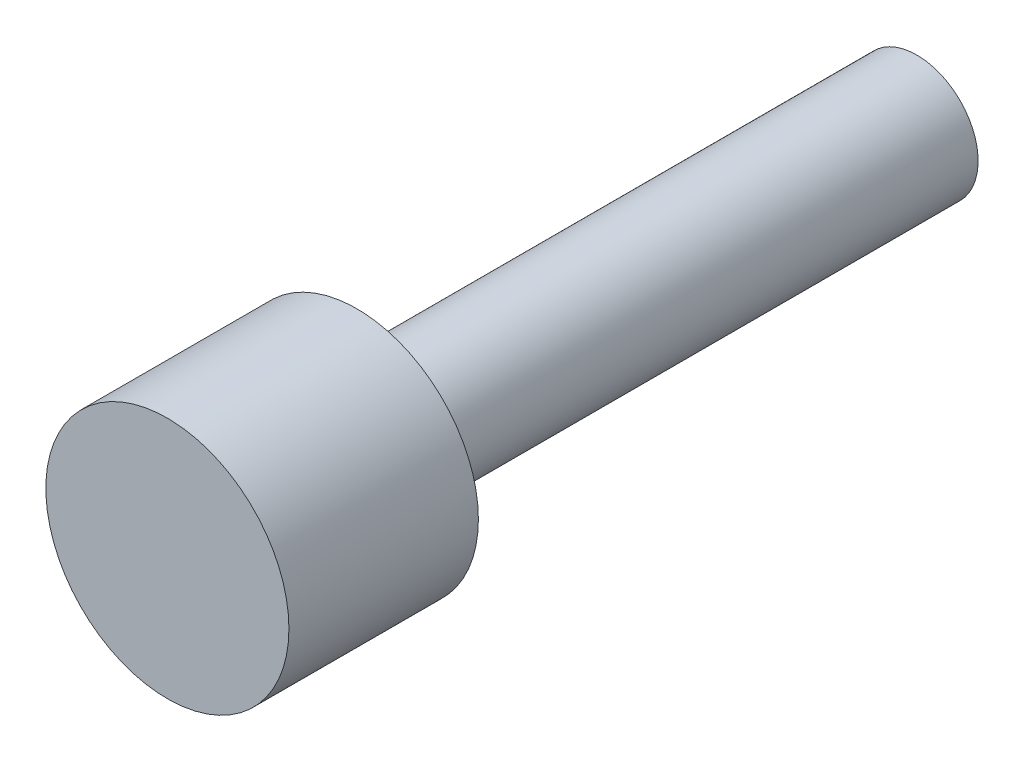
ISO-10303-21;
HEADER;
FILE_DESCRIPTION(('STEP AP214'),'2;1');
FILE_NAME('part.step','',(''),(''),'','','');
FILE_SCHEMA(('AUTOMOTIVE_DESIGN { 1 0 10303 214 1 1 1 1 }'));
ENDSEC;
DATA;
#1=APPLICATION_CONTEXT('core data for automotive mechanical design processes');
#2=APPLICATION_PROTOCOL_DEFINITION('international standard','automotive_design',2000,#1);
#3=PRODUCT_CONTEXT('',#1,'mechanical');
#4=PRODUCT('Part','Part','',(#3));
#5=PRODUCT_RELATED_PRODUCT_CATEGORY('part','',(#4));
#6=PRODUCT_DEFINITION_FORMATION('','',#4);
#7=PRODUCT_DEFINITION_CONTEXT('part definition',#1,'design');
#8=PRODUCT_DEFINITION('design','',#6,#7);
#9=PRODUCT_DEFINITION_SHAPE('','',#8);
#10=(LENGTH_UNIT() NAMED_UNIT(*) SI_UNIT(.MILLI.,.METRE.));
#11=(NAMED_UNIT(*) PLANE_ANGLE_UNIT() SI_UNIT($,.RADIAN.));
#12=(NAMED_UNIT(*) SI_UNIT($,.STERADIAN.) SOLID_ANGLE_UNIT());
#13=UNCERTAINTY_MEASURE_WITH_UNIT(LENGTH_MEASURE(1.E-05),#10,'distance_accuracy_value','');
#14=(GEOMETRIC_REPRESENTATION_CONTEXT(3) GLOBAL_UNCERTAINTY_ASSIGNED_CONTEXT((#13)) GLOBAL_UNIT_ASSIGNED_CONTEXT((#10,
#11,#12)) REPRESENTATION_CONTEXT('',''));
#15=CARTESIAN_POINT('',(0.,0.,0.));
#16=DIRECTION('',(0.,0.,1.));
#17=DIRECTION('',(1.,0.,0.));
#18=AXIS2_PLACEMENT_3D('',#15,#16,#17);
#19=CARTESIAN_POINT('',(2.54313205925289,-4.19094893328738,-11.1347234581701));
#20=DIRECTION('',(0.,0.,-1.));
#21=DIRECTION('',(0.854911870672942,0.518773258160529,0.));
#22=AXIS2_PLACEMENT_3D('',#19,#20,#21);
#23=PLANE('',#22);
#24=CARTESIAN_POINT('',(0.,0.,-11.1347234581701));
#25=DIRECTION('',(0.,0.,-1.));
#26=DIRECTION('',(-1.,0.,0.));
#27=AXIS2_PLACEMENT_3D('',#24,#25,#26);
#28=CIRCLE('',#27,3.59537);
#29=CARTESIAN_POINT('',(-3.59537,0.,-11.1347234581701));
#30=VERTEX_POINT('',#29);
#31=EDGE_CURVE('E10',#30,#30,#28,.T.);
#32=ORIENTED_EDGE('',*,*,#31,.F.);
#33=EDGE_LOOP('',(#32));
#34=FACE_BOUND('',#33,.T.);
#35=CARTESIAN_POINT('',(0.,0.,-11.1347234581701));
#36=DIRECTION('',(0.,0.,-1.));
#37=DIRECTION('',(-1.,0.,0.));
#38=AXIS2_PLACEMENT_3D('',#35,#36,#37);
#39=CIRCLE('',#38,7.14375000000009);
#40=CARTESIAN_POINT('',(-7.14375000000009,0.,-11.1347234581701));
#41=VERTEX_POINT('',#40);
#42=EDGE_CURVE('E36',#41,#41,#39,.F.);
#43=ORIENTED_EDGE('',*,*,#42,.F.);
#44=EDGE_LOOP('',(#43));
#45=FACE_BOUND('',#44,.T.);
#46=ADVANCED_FACE('F33',(#34,#45),#23,.T.);
#47=CARTESIAN_POINT('',(0.,0.,0.));
#48=DIRECTION('',(0.,0.,1.));
#49=DIRECTION('',(1.,0.,0.));
#50=AXIS2_PLACEMENT_3D('',#47,#48,#49);
#51=PLANE('',#50);
#52=CARTESIAN_POINT('',(0.,0.,0.));
#53=DIRECTION('',(0.,0.,1.));
#54=DIRECTION('',(1.,0.,0.));
#55=AXIS2_PLACEMENT_3D('',#52,#53,#54);
#56=CIRCLE('',#55,7.14375000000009);
#57=CARTESIAN_POINT('',(7.14375000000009,0.,0.));
#58=VERTEX_POINT('',#57);
#59=EDGE_CURVE('E44',#58,#58,#56,.T.);
#60=ORIENTED_EDGE('',*,*,#59,.T.);
#61=EDGE_LOOP('',(#60));
#62=FACE_BOUND('',#61,.T.);
#63=ADVANCED_FACE('F51',(#62),#51,.T.);
#64=CARTESIAN_POINT('',(0.,0.,-31.3402997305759));
#65=DIRECTION('',(0.,0.,1.));
#66=DIRECTION('',(1.,0.,0.));
#67=AXIS2_PLACEMENT_3D('',#64,#65,#66);
#68=CYLINDRICAL_SURFACE('',#67,7.14375000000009);
#69=ORIENTED_EDGE('',*,*,#59,.F.);
#70=EDGE_LOOP('',(#69));
#71=FACE_BOUND('',#70,.T.);
#72=ORIENTED_EDGE('',*,*,#42,.T.);
#73=EDGE_LOOP('',(#72));
#74=FACE_BOUND('',#73,.T.);
#75=ADVANCED_FACE('F53',(#71,#74),#68,.T.);
#76=CARTESIAN_POINT('',(0.,0.,-54.2223670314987));
#77=DIRECTION('',(0.,0.,1.));
#78=DIRECTION('',(1.,0.,0.));
#79=AXIS2_PLACEMENT_3D('',#76,#77,#78);
#80=CYLINDRICAL_SURFACE('',#79,3.59537);
#81=ORIENTED_EDGE('',*,*,#31,.T.);
#82=EDGE_LOOP('',(#81));
#83=FACE_BOUND('',#82,.T.);
#84=CARTESIAN_POINT('',(0.,0.,-44.053125));
#85=DIRECTION('',(0.,0.,-1.));
#86=DIRECTION('',(-1.,0.,0.));
#87=AXIS2_PLACEMENT_3D('',#84,#85,#86);
#88=CIRCLE('',#87,3.59537);
#89=CARTESIAN_POINT('',(-3.59537,0.,-44.053125));
#90=VERTEX_POINT('',#89);
#91=EDGE_CURVE('E46',#90,#90,#88,.T.);
#92=ORIENTED_EDGE('',*,*,#91,.F.);
#93=EDGE_LOOP('',(#92));
#94=FACE_BOUND('',#93,.T.);
#95=ADVANCED_FACE('F56',(#83,#94),#80,.T.);
#96=CARTESIAN_POINT('',(1.64965651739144E-13,0.,-44.053125));
#97=DIRECTION('',(0.,0.,-1.));
#98=DIRECTION('',(-1.,0.,0.));
#99=AXIS2_PLACEMENT_3D('',#96,#97,#98);
#100=PLANE('',#99);
#101=ORIENTED_EDGE('',*,*,#91,.T.);
#102=EDGE_LOOP('',(#101));
#103=FACE_BOUND('',#102,.T.);
#104=ADVANCED_FACE('F68',(#103),#100,.T.);
#105=CLOSED_SHELL('',(#46,#63,#75,#95,#104));
#106=MANIFOLD_SOLID_BREP('B2',#105);
#107=ADVANCED_BREP_SHAPE_REPRESENTATION('',(#18,#106),#14);
#108=SHAPE_DEFINITION_REPRESENTATION(#9,#107);
ENDSEC;
END-ISO-10303-21;
